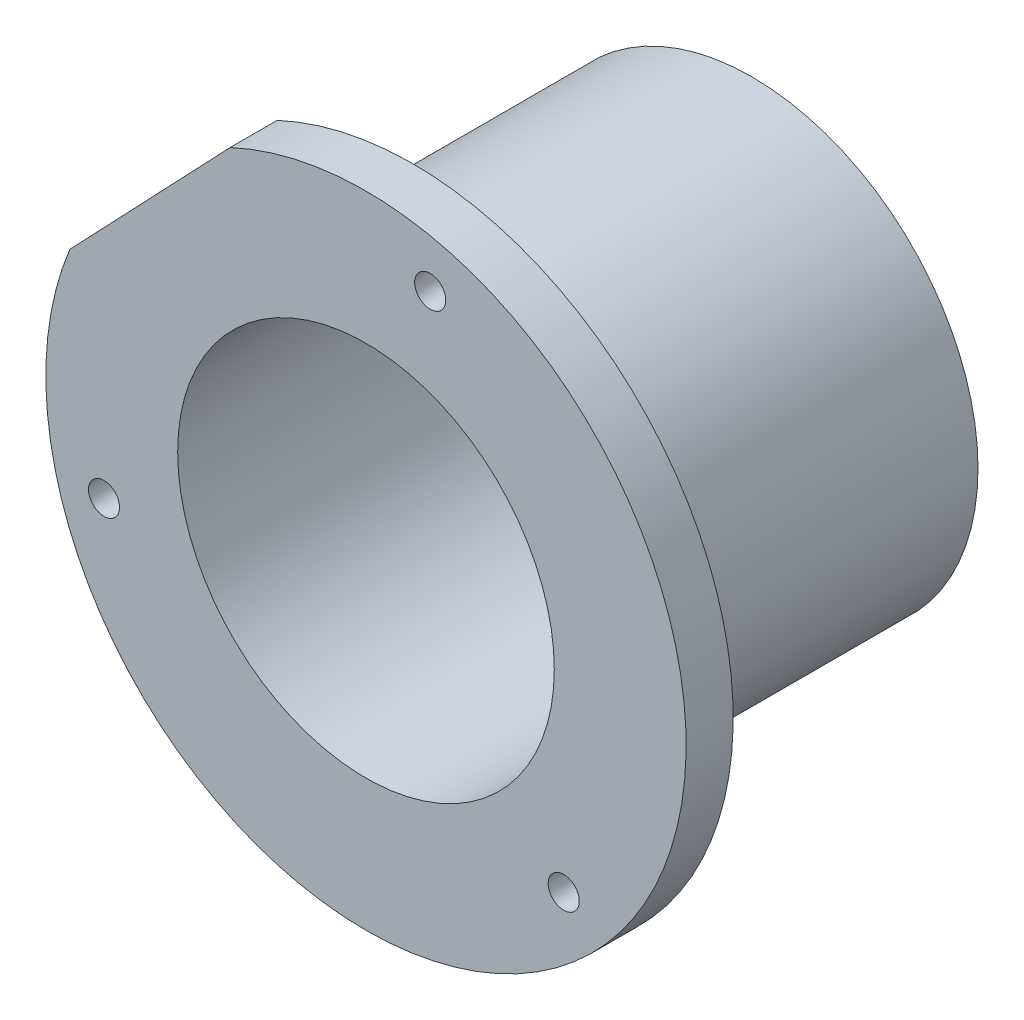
ISO-10303-21;
HEADER;
FILE_DESCRIPTION(('STEP AP214'),'2;1');
FILE_NAME('part.step','',(''),(''),'','','');
FILE_SCHEMA(('AUTOMOTIVE_DESIGN { 1 0 10303 214 1 1 1 1 }'));
ENDSEC;
DATA;
#1=APPLICATION_CONTEXT('core data for automotive mechanical design processes');
#2=APPLICATION_PROTOCOL_DEFINITION('international standard','automotive_design',2000,#1);
#3=PRODUCT_CONTEXT('',#1,'mechanical');
#4=PRODUCT('Part','Part','',(#3));
#5=PRODUCT_RELATED_PRODUCT_CATEGORY('part','',(#4));
#6=PRODUCT_DEFINITION_FORMATION('','',#4);
#7=PRODUCT_DEFINITION_CONTEXT('part definition',#1,'design');
#8=PRODUCT_DEFINITION('design','',#6,#7);
#9=PRODUCT_DEFINITION_SHAPE('','',#8);
#10=(LENGTH_UNIT() NAMED_UNIT(*) SI_UNIT(.MILLI.,.METRE.));
#11=(NAMED_UNIT(*) PLANE_ANGLE_UNIT() SI_UNIT($,.RADIAN.));
#12=(NAMED_UNIT(*) SI_UNIT($,.STERADIAN.) SOLID_ANGLE_UNIT());
#13=UNCERTAINTY_MEASURE_WITH_UNIT(LENGTH_MEASURE(1.E-05),#10,'distance_accuracy_value','');
#14=(GEOMETRIC_REPRESENTATION_CONTEXT(3) GLOBAL_UNCERTAINTY_ASSIGNED_CONTEXT((#13)) GLOBAL_UNIT_ASSIGNED_CONTEXT((#10,
#11,#12)) REPRESENTATION_CONTEXT('',''));
#15=CARTESIAN_POINT('',(0.,0.,0.));
#16=DIRECTION('',(0.,0.,1.));
#17=DIRECTION('',(1.,0.,0.));
#18=AXIS2_PLACEMENT_3D('',#15,#16,#17);
#19=CARTESIAN_POINT('',(17.,52.,2.));
#20=DIRECTION('',(0.,0.,-1.));
#21=DIRECTION('',(-1.,0.,0.));
#22=AXIS2_PLACEMENT_3D('',#19,#20,#21);
#23=CYLINDRICAL_SURFACE('',#22,20.);
#24=CARTESIAN_POINT('',(17.,52.,-30.));
#25=DIRECTION('',(0.,0.,-1.));
#26=DIRECTION('',(-1.,0.,0.));
#27=AXIS2_PLACEMENT_3D('',#24,#25,#26);
#28=CIRCLE('',#27,20.);
#29=CARTESIAN_POINT('',(-3.00000000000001,52.,-30.));
#30=VERTEX_POINT('',#29);
#31=EDGE_CURVE('E86',#30,#30,#28,.T.);
#32=ORIENTED_EDGE('',*,*,#31,.T.);
#33=EDGE_LOOP('',(#32));
#34=FACE_BOUND('',#33,.T.);
#35=CARTESIAN_POINT('',(17.,52.,6.99999999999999));
#36=DIRECTION('',(0.,0.,1.));
#37=DIRECTION('',(1.,0.,0.));
#38=AXIS2_PLACEMENT_3D('',#35,#36,#37);
#39=CIRCLE('',#38,20.);
#40=CARTESIAN_POINT('',(37.,52.,6.99999999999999));
#41=VERTEX_POINT('',#40);
#42=EDGE_CURVE('E73',#41,#41,#39,.T.);
#43=ORIENTED_EDGE('',*,*,#42,.T.);
#44=EDGE_LOOP('',(#43));
#45=FACE_BOUND('',#44,.T.);
#46=ADVANCED_FACE('F31',(#34,#45),#23,.F.);
#47=CARTESIAN_POINT('',(17.,52.,2.));
#48=DIRECTION('',(0.,0.,-1.));
#49=DIRECTION('',(-1.,0.,0.));
#50=AXIS2_PLACEMENT_3D('',#47,#48,#49);
#51=CYLINDRICAL_SURFACE('',#50,24.);
#52=CARTESIAN_POINT('',(17.,52.,2.));
#53=DIRECTION('',(0.,0.,1.));
#54=DIRECTION('',(1.,0.,0.));
#55=AXIS2_PLACEMENT_3D('',#52,#53,#54);
#56=CIRCLE('',#55,24.);
#57=CARTESIAN_POINT('',(41.,52.,2.));
#58=VERTEX_POINT('',#57);
#59=EDGE_CURVE('E11',#58,#58,#56,.T.);
#60=ORIENTED_EDGE('',*,*,#59,.F.);
#61=EDGE_LOOP('',(#60));
#62=FACE_BOUND('',#61,.T.);
#63=CARTESIAN_POINT('',(17.,52.,-34.));
#64=DIRECTION('',(0.,0.,1.));
#65=DIRECTION('',(1.,0.,0.));
#66=AXIS2_PLACEMENT_3D('',#63,#64,#65);
#67=CIRCLE('',#66,24.);
#68=CARTESIAN_POINT('',(41.,52.,-34.));
#69=VERTEX_POINT('',#68);
#70=EDGE_CURVE('E40',#69,#69,#67,.T.);
#71=ORIENTED_EDGE('',*,*,#70,.T.);
#72=EDGE_LOOP('',(#71));
#73=FACE_BOUND('',#72,.T.);
#74=ADVANCED_FACE('F33',(#62,#73),#51,.T.);
#75=CARTESIAN_POINT('',(17.,52.,-34.));
#76=DIRECTION('',(0.,0.,1.));
#77=DIRECTION('',(1.,0.,0.));
#78=AXIS2_PLACEMENT_3D('',#75,#76,#77);
#79=PLANE('',#78);
#80=ORIENTED_EDGE('',*,*,#70,.F.);
#81=EDGE_LOOP('',(#80));
#82=FACE_BOUND('',#81,.T.);
#83=CARTESIAN_POINT('',(17.,52.,-34.));
#84=DIRECTION('',(0.,0.,-1.));
#85=DIRECTION('',(-1.,0.,0.));
#86=AXIS2_PLACEMENT_3D('',#83,#84,#85);
#87=CIRCLE('',#86,15.);
#88=CARTESIAN_POINT('',(2.,52.,-34.));
#89=VERTEX_POINT('',#88);
#90=EDGE_CURVE('E82',#89,#89,#87,.T.);
#91=ORIENTED_EDGE('',*,*,#90,.F.);
#92=EDGE_LOOP('',(#91));
#93=FACE_BOUND('',#92,.T.);
#94=ADVANCED_FACE('F94',(#82,#93),#79,.F.);
#95=CARTESIAN_POINT('',(17.,52.,-30.));
#96=DIRECTION('',(0.,0.,-1.));
#97=DIRECTION('',(-1.,0.,0.));
#98=AXIS2_PLACEMENT_3D('',#95,#96,#97);
#99=PLANE('',#98);
#100=CARTESIAN_POINT('',(17.,52.,-30.));
#101=DIRECTION('',(0.,0.,-1.));
#102=DIRECTION('',(-1.,0.,0.));
#103=AXIS2_PLACEMENT_3D('',#100,#101,#102);
#104=CIRCLE('',#103,15.);
#105=CARTESIAN_POINT('',(2.,52.,-30.));
#106=VERTEX_POINT('',#105);
#107=EDGE_CURVE('E83',#106,#106,#104,.T.);
#108=ORIENTED_EDGE('',*,*,#107,.T.);
#109=EDGE_LOOP('',(#108));
#110=FACE_BOUND('',#109,.T.);
#111=ORIENTED_EDGE('',*,*,#31,.F.);
#112=EDGE_LOOP('',(#111));
#113=FACE_BOUND('',#112,.T.);
#114=ADVANCED_FACE('F97',(#110,#113),#99,.F.);
#115=CARTESIAN_POINT('',(17.,52.,-30.));
#116=DIRECTION('',(0.,0.,-1.));
#117=DIRECTION('',(-1.,0.,0.));
#118=AXIS2_PLACEMENT_3D('',#115,#116,#117);
#119=CYLINDRICAL_SURFACE('',#118,15.);
#120=ORIENTED_EDGE('',*,*,#107,.F.);
#121=EDGE_LOOP('',(#120));
#122=FACE_BOUND('',#121,.T.);
#123=ORIENTED_EDGE('',*,*,#90,.T.);
#124=EDGE_LOOP('',(#123));
#125=FACE_BOUND('',#124,.T.);
#126=ADVANCED_FACE('F101',(#122,#125),#119,.F.);
#127=CARTESIAN_POINT('',(17.,52.,2.));
#128=DIRECTION('',(0.,0.,1.));
#129=DIRECTION('',(1.,0.,0.));
#130=AXIS2_PLACEMENT_3D('',#127,#128,#129);
#131=PLANE('',#130);
#132=CARTESIAN_POINT('',(23.820508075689,80.1865334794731,2.));
#133=DIRECTION('',(0.,0.,1.));
#134=DIRECTION('',(1.,0.,0.));
#135=AXIS2_PLACEMENT_3D('',#132,#133,#134);
#136=CIRCLE('',#135,1.64999999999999);
#137=CARTESIAN_POINT('',(25.470508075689,80.1865334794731,2.));
#138=VERTEX_POINT('',#137);
#139=EDGE_CURVE('E165',#138,#138,#136,.T.);
#140=ORIENTED_EDGE('',*,*,#139,.T.);
#141=EDGE_LOOP('',(#140));
#142=FACE_BOUND('',#141,.T.);
#143=CARTESIAN_POINT('',(-10.8205080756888,43.8134665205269,2.));
#144=DIRECTION('',(0.,0.,1.));
#145=DIRECTION('',(1.,0.,0.));
#146=AXIS2_PLACEMENT_3D('',#143,#144,#145);
#147=CIRCLE('',#146,1.64999999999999);
#148=CARTESIAN_POINT('',(-9.17050807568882,43.8134665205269,2.));
#149=VERTEX_POINT('',#148);
#150=EDGE_CURVE('E157',#149,#149,#147,.T.);
#151=ORIENTED_EDGE('',*,*,#150,.T.);
#152=EDGE_LOOP('',(#151));
#153=FACE_BOUND('',#152,.T.);
#154=CARTESIAN_POINT('',(38.,32.,2.));
#155=DIRECTION('',(0.,0.,1.));
#156=DIRECTION('',(1.,0.,0.));
#157=AXIS2_PLACEMENT_3D('',#154,#155,#156);
#158=CIRCLE('',#157,1.64999999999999);
#159=CARTESIAN_POINT('',(39.65,32.,2.));
#160=VERTEX_POINT('',#159);
#161=EDGE_CURVE('E76',#160,#160,#158,.T.);
#162=ORIENTED_EDGE('',*,*,#161,.T.);
#163=EDGE_LOOP('',(#162));
#164=FACE_BOUND('',#163,.T.);
#165=CARTESIAN_POINT('',(17.,52.,2.));
#166=DIRECTION('',(0.,0.,1.));
#167=DIRECTION('',(1.,0.,0.));
#168=AXIS2_PLACEMENT_3D('',#165,#166,#167);
#169=CIRCLE('',#168,34.);
#170=CARTESIAN_POINT('',(-14.4528021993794,64.9120576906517,2.));
#171=VERTEX_POINT('',#170);
#172=CARTESIAN_POINT('',(2.56992467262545,82.7859209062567,2.));
#173=VERTEX_POINT('',#172);
#174=EDGE_CURVE('E66',#171,#173,#169,.T.);
#175=ORIENTED_EDGE('',*,*,#174,.F.);
#176=DIRECTION('',(-0.689655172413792,-0.724137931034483,0.));
#177=VECTOR('',#176,1.);
#178=CARTESIAN_POINT('',(2.56992467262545,82.7859209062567,2.));
#179=LINE('',#178,#177);
#180=EDGE_CURVE('E55',#173,#171,#179,.T.);
#181=ORIENTED_EDGE('',*,*,#180,.F.);
#182=EDGE_LOOP('',(#175,#181));
#183=FACE_BOUND('',#182,.T.);
#184=ORIENTED_EDGE('',*,*,#59,.T.);
#185=EDGE_LOOP('',(#184));
#186=FACE_BOUND('',#185,.T.);
#187=ADVANCED_FACE('F71',(#142,#153,#164,#183,#186),#131,.F.);
#188=CARTESIAN_POINT('',(17.,52.,6.99999999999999));
#189=DIRECTION('',(0.,0.,1.));
#190=DIRECTION('',(1.,0.,0.));
#191=AXIS2_PLACEMENT_3D('',#188,#189,#190);
#192=PLANE('',#191);
#193=CARTESIAN_POINT('',(23.820508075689,80.1865334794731,6.99999999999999));
#194=DIRECTION('',(0.,0.,1.));
#195=DIRECTION('',(1.,0.,0.));
#196=AXIS2_PLACEMENT_3D('',#193,#194,#195);
#197=CIRCLE('',#196,1.64999999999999);
#198=CARTESIAN_POINT('',(25.470508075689,80.1865334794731,6.99999999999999));
#199=VERTEX_POINT('',#198);
#200=EDGE_CURVE('E168',#199,#199,#197,.T.);
#201=ORIENTED_EDGE('',*,*,#200,.F.);
#202=EDGE_LOOP('',(#201));
#203=FACE_BOUND('',#202,.T.);
#204=CARTESIAN_POINT('',(-10.8205080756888,43.8134665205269,7.00000000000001));
#205=DIRECTION('',(0.,0.,1.));
#206=DIRECTION('',(1.,0.,0.));
#207=AXIS2_PLACEMENT_3D('',#204,#205,#206);
#208=CIRCLE('',#207,1.64999999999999);
#209=CARTESIAN_POINT('',(-9.17050807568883,43.8134665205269,7.00000000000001));
#210=VERTEX_POINT('',#209);
#211=EDGE_CURVE('E162',#210,#210,#208,.T.);
#212=ORIENTED_EDGE('',*,*,#211,.F.);
#213=EDGE_LOOP('',(#212));
#214=FACE_BOUND('',#213,.T.);
#215=CARTESIAN_POINT('',(38.,32.,6.99999999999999));
#216=DIRECTION('',(0.,0.,1.));
#217=DIRECTION('',(1.,0.,0.));
#218=AXIS2_PLACEMENT_3D('',#215,#216,#217);
#219=CIRCLE('',#218,1.64999999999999);
#220=CARTESIAN_POINT('',(39.65,32.,6.99999999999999));
#221=VERTEX_POINT('',#220);
#222=EDGE_CURVE('E152',#221,#221,#219,.T.);
#223=ORIENTED_EDGE('',*,*,#222,.F.);
#224=EDGE_LOOP('',(#223));
#225=FACE_BOUND('',#224,.T.);
#226=CARTESIAN_POINT('',(17.,52.,6.99999999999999));
#227=DIRECTION('',(0.,0.,1.));
#228=DIRECTION('',(1.,0.,0.));
#229=AXIS2_PLACEMENT_3D('',#226,#227,#228);
#230=CIRCLE('',#229,34.);
#231=CARTESIAN_POINT('',(-14.4528021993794,64.9120576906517,7.00000000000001));
#232=VERTEX_POINT('',#231);
#233=CARTESIAN_POINT('',(2.56992467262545,82.7859209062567,7.00000000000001));
#234=VERTEX_POINT('',#233);
#235=EDGE_CURVE('E65',#232,#234,#230,.T.);
#236=ORIENTED_EDGE('',*,*,#235,.T.);
#237=DIRECTION('',(-0.689655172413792,-0.724137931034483,0.));
#238=VECTOR('',#237,1.);
#239=CARTESIAN_POINT('',(2.56992467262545,82.7859209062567,7.00000000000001));
#240=LINE('',#239,#238);
#241=EDGE_CURVE('E47',#234,#232,#240,.T.);
#242=ORIENTED_EDGE('',*,*,#241,.T.);
#243=EDGE_LOOP('',(#236,#242));
#244=FACE_BOUND('',#243,.T.);
#245=ORIENTED_EDGE('',*,*,#42,.F.);
#246=EDGE_LOOP('',(#245));
#247=FACE_BOUND('',#246,.T.);
#248=ADVANCED_FACE('F109',(#203,#214,#225,#244,#247),#192,.T.);
#249=CARTESIAN_POINT('',(17.,52.,6.99999999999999));
#250=DIRECTION('',(0.,0.,-1.));
#251=DIRECTION('',(-1.,0.,0.));
#252=AXIS2_PLACEMENT_3D('',#249,#250,#251);
#253=CYLINDRICAL_SURFACE('',#252,34.);
#254=ORIENTED_EDGE('',*,*,#174,.T.);
#255=DIRECTION('',(0.,0.,-1.));
#256=VECTOR('',#255,1.);
#257=CARTESIAN_POINT('',(2.56992467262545,82.7859209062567,7.00000000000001));
#258=LINE('',#257,#256);
#259=EDGE_CURVE('E63',#234,#173,#258,.T.);
#260=ORIENTED_EDGE('',*,*,#259,.F.);
#261=ORIENTED_EDGE('',*,*,#235,.F.);
#262=DIRECTION('',(0.,0.,-1.));
#263=VECTOR('',#262,1.);
#264=CARTESIAN_POINT('',(-14.4528021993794,64.9120576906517,7.00000000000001));
#265=LINE('',#264,#263);
#266=EDGE_CURVE('E60',#232,#171,#265,.T.);
#267=ORIENTED_EDGE('',*,*,#266,.T.);
#268=EDGE_LOOP('',(#254,#260,#261,#267));
#269=FACE_BOUND('',#268,.T.);
#270=ADVANCED_FACE('F69',(#269),#253,.T.);
#271=CARTESIAN_POINT('',(2.56992467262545,82.7859209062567,7.00000000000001));
#272=DIRECTION('',(0.724137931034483,-0.689655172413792,0.));
#273=DIRECTION('',(0.689655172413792,0.724137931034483,0.));
#274=AXIS2_PLACEMENT_3D('',#271,#272,#273);
#275=PLANE('',#274);
#276=ORIENTED_EDGE('',*,*,#180,.T.);
#277=ORIENTED_EDGE('',*,*,#266,.F.);
#278=ORIENTED_EDGE('',*,*,#241,.F.);
#279=ORIENTED_EDGE('',*,*,#259,.T.);
#280=EDGE_LOOP('',(#276,#277,#278,#279));
#281=FACE_BOUND('',#280,.T.);
#282=ADVANCED_FACE('F59',(#281),#275,.F.);
#283=CARTESIAN_POINT('',(38.,32.,6.99999999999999));
#284=DIRECTION('',(0.,0.,1.));
#285=DIRECTION('',(1.,0.,0.));
#286=AXIS2_PLACEMENT_3D('',#283,#284,#285);
#287=CYLINDRICAL_SURFACE('',#286,1.64999999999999);
#288=ORIENTED_EDGE('',*,*,#222,.T.);
#289=EDGE_LOOP('',(#288));
#290=FACE_BOUND('',#289,.T.);
#291=ORIENTED_EDGE('',*,*,#161,.F.);
#292=EDGE_LOOP('',(#291));
#293=FACE_BOUND('',#292,.T.);
#294=ADVANCED_FACE('F135',(#290,#293),#287,.F.);
#295=CARTESIAN_POINT('',(-10.8205080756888,43.8134665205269,7.00000000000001));
#296=DIRECTION('',(0.,0.,1.));
#297=DIRECTION('',(1.,0.,0.));
#298=AXIS2_PLACEMENT_3D('',#295,#296,#297);
#299=CYLINDRICAL_SURFACE('',#298,1.64999999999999);
#300=ORIENTED_EDGE('',*,*,#211,.T.);
#301=EDGE_LOOP('',(#300));
#302=FACE_BOUND('',#301,.T.);
#303=ORIENTED_EDGE('',*,*,#150,.F.);
#304=EDGE_LOOP('',(#303));
#305=FACE_BOUND('',#304,.T.);
#306=ADVANCED_FACE('F142',(#302,#305),#299,.F.);
#307=CARTESIAN_POINT('',(23.820508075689,80.1865334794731,6.99999999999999));
#308=DIRECTION('',(0.,0.,1.));
#309=DIRECTION('',(1.,0.,0.));
#310=AXIS2_PLACEMENT_3D('',#307,#308,#309);
#311=CYLINDRICAL_SURFACE('',#310,1.64999999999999);
#312=ORIENTED_EDGE('',*,*,#200,.T.);
#313=EDGE_LOOP('',(#312));
#314=FACE_BOUND('',#313,.T.);
#315=ORIENTED_EDGE('',*,*,#139,.F.);
#316=EDGE_LOOP('',(#315));
#317=FACE_BOUND('',#316,.T.);
#318=ADVANCED_FACE('F147',(#314,#317),#311,.F.);
#319=CLOSED_SHELL('',(#46,#74,#94,#114,#126,#187,#248,#270,#282,#294,#306,#318));
#320=MANIFOLD_SOLID_BREP('B2',#319);
#321=ADVANCED_BREP_SHAPE_REPRESENTATION('',(#18,#320),#14);
#322=SHAPE_DEFINITION_REPRESENTATION(#9,#321);
ENDSEC;
END-ISO-10303-21;
